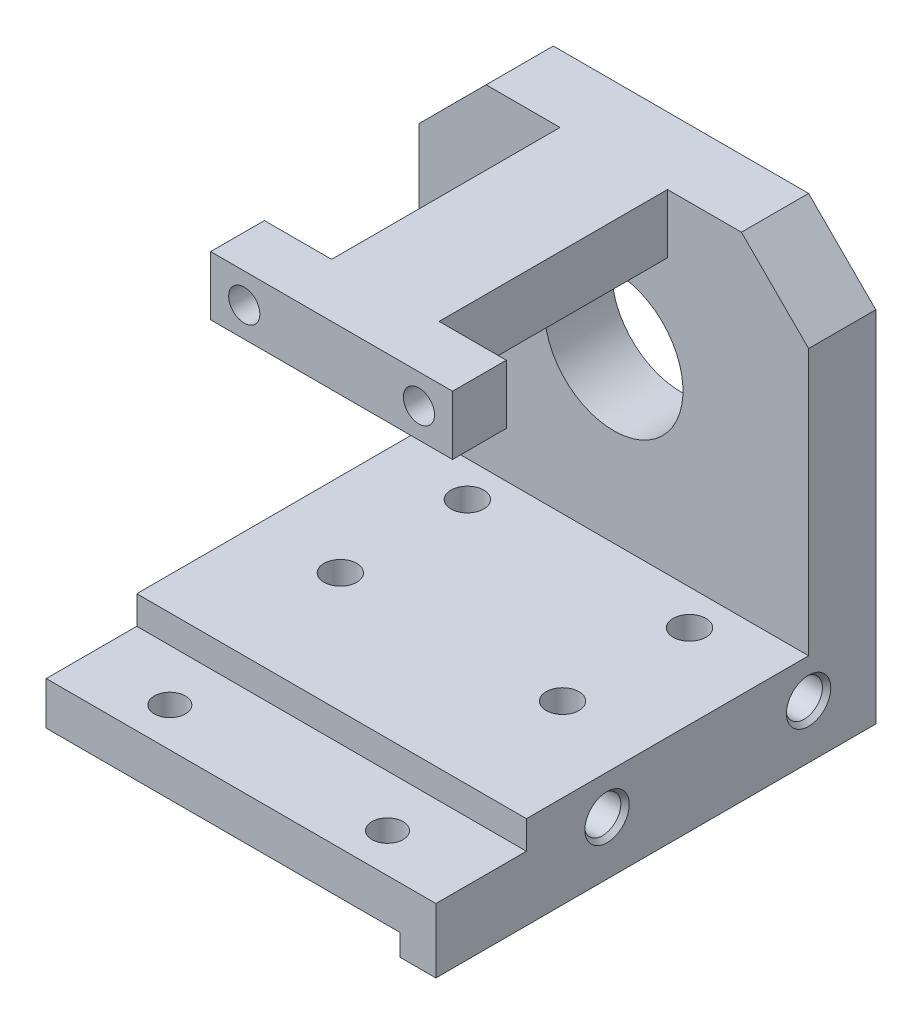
from build123d import *

# Parameters (mm, degrees)
SKETCH1_W                       = 36.83
SKETCH1_H                       = 38.227
EXTRUDE1_DEPTH                  = 6.35
SKETCH8_R                       = 1.5875
EXTRUDE3_DEPTH                  = 0.00254
SKETCH12_R                      = 6.5405
CUT_EXTRUDE3_DEPTH              = 30.745124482
SKETCH13_W                      = 36.83
SKETCH13_H                      = 6.731
EXTRUDE4_DEPTH                  = 36.83
SKETCH14_W                      = 10.16
SKETCH14_H                      = 2.667
CUT_EXTRUDE4_DEPTH              = 62.043154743
SKETCH16_W                      = 3.415000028
SKETCH16_H                      = 43.18
EXTRUDE5_DEPTH                  = 2.032
SKETCH17_W                      = 10.16
SKETCH17_H                      = 5.588
EXTRUDE6_DEPTH                  = 26.67
SKETCH18_W                      = 5.08
SKETCH18_H                      = 5.588
EXTRUDE7_DEPTH                  = 6.35
CHAMFER2_SIZE                   = 6.35
SKETCH21_W                      = 43.18
SKETCH21_H                      = 2.032
CUT_EXTRUDE5_DEPTH              = 60.848673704
F_32_0_116000_DIAMETER_HOLE2_D  = 2.9464
M3_1_3_100000_DIAMETER_HOLE1_D  = 3.1
SKETCH27_W                      = 36.83
SKETCH27_H                      = 6.096
CUT_EXTRUDE7_DEPTH              = 1.6026003
F_8_32_TAPPED_HOLE2_D           = 3.4544
F_8_32_TAPPED_HOLE2_DEPTH       = 10.7188
F_8_32_TAPPED_HOLE2_CSINK_D     = 4.191
F_8_32_TAPPED_HOLE2_CSINK_ANGLE = 82
SKETCH41_R                      = 13.97
SKETCH41_R_2                    = 6.5405
CUT_EXTRUDE9_DEPTH              = 0.254
BOSS_EXTRUDE1_START             = 0.254
SKETCH42_R                      = 7.9375
SKETCH42_R_2                    = 6.5405
BOSS_EXTRUDE1_DEPTH             = 0.254


with BuildPart() as part:
    # Sketch1 → Extrude1 (new body)
    with BuildSketch(Plane.XY):
        with Locations((0, -3.3655)):
            Rectangle(SKETCH1_W, SKETCH1_H)
    extrude(amount=EXTRUDE1_DEPTH)

    # Sketch8 → Extrude3 (add)
    with BuildSketch(Plane(origin=(0, 0, 0), x_dir=(-1, 0, 0), z_dir=(0, 0, -1))):
        with Locations(Location((-1.9685, -3.064398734, 0), (0, 0, 180))):
            Circle(SKETCH8_R)
    extrude(amount=EXTRUDE3_DEPTH)

    # Sketch12 → Cut-Extrude3 (cut, through all)
    with BuildSketch(Plane(origin=(0, 0, -0.00254), x_dir=(-1, 0, 0), z_dir=(0, 0, -1))):
        Circle(SKETCH12_R)
    extrude(amount=-CUT_EXTRUDE3_DEPTH, mode=Mode.SUBTRACT)

    # Sketch13 → Extrude4 (add)
    with BuildSketch(Plane.XY.offset(6.35)):
        with Locations((0, -19.1135)):
            Rectangle(SKETCH13_W, SKETCH13_H)
    extrude(amount=EXTRUDE4_DEPTH)

    # Sketch14 → Cut-Extrude4 (cut, through all)
    with BuildSketch(Plane.ZY.offset(18.415)):
        with Locations((38.1, -17.0815)):
            Rectangle(SKETCH14_W, SKETCH14_H)
    extrude(amount=-CUT_EXTRUDE4_DEPTH, mode=Mode.SUBTRACT)

    # Sketch16 → Extrude5 (add)
    with BuildSketch(Plane.XZ.offset(22.479)):
        with Locations((16.707499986, 21.59)):
            Rectangle(SKETCH16_W, SKETCH16_H)
        with Locations((-16.707499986, 21.59)):
            Rectangle(SKETCH16_W, SKETCH16_H)
    extrude(amount=EXTRUDE5_DEPTH)

    # Sketch17 → Extrude6 (add)
    with BuildSketch(Plane.XY.offset(6.35)):
        with Locations((0, 12.954)):
            Rectangle(SKETCH17_W, SKETCH17_H)
    extrude(amount=EXTRUDE6_DEPTH)

    # Sketch18 → Extrude7 (add)
    with BuildSketch(Plane.ZY.offset(5.08)):
        with Locations((30.48, 12.954)):
            Rectangle(SKETCH18_W, SKETCH18_H)
    extrude7 = extrude(amount=EXTRUDE7_DEPTH)

    # Mirror1: Extrude7 across plane
    add(extrude7.mirror(Plane(origin=(0, 0, 0), x_dir=(0, 0, 1), z_dir=(1, 0, 0))))

    # Sketch19 → 32 _0.116000_ Diameter Hole1 (revolve, cut)
    with BuildSketch(Plane(origin=(-8.255, 12.954, 27.94), x_dir=(0, 1, 0), z_dir=(1, 0, 0))):
        Polygon((0, 0), (0, 26.285187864), (1.4732, 25.4), (1.4732, 0), align=None)
    f_32_0_116000_diameter_hole1 = revolve(axis=Axis((-8.255, 12.954, 21.59), (0, 0, 1)), mode=Mode.SUBTRACT)

    # Mirror2: 32 _0.116000_ Diameter Hole1 across plane
    add(f_32_0_116000_diameter_hole1.mirror(Plane(origin=(0, 0, 0), x_dir=(0, 0, 1), z_dir=(1, 0, 0))), mode=Mode.SUBTRACT)

    # Chamfer2
    chamfer2_edges = [part.edges().sort_by_distance(p)[0] for p in [
        (18.415, 15.748, 3.175),
        (-18.415, 15.748, 3.175),
    ]]
    chamfer(chamfer2_edges, length=CHAMFER2_SIZE)

    # Sketch21 → Cut-Extrude5 (cut, through all)
    with BuildSketch(Plane(origin=(-14.999999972, 0, 0), x_dir=(0, 0, -1), z_dir=(1, 0, 0))):
        with Locations((-21.59, -23.495)):
            Rectangle(SKETCH21_W, SKETCH21_H)
    extrude(amount=-CUT_EXTRUDE5_DEPTH, mode=Mode.SUBTRACT)

    # 32 _0.116000_ Diameter Hole2 (through all)
    with Locations(Plane.XZ.offset(22.479)):
        with Locations((10.16, 37.8943997), (-10.414, 37.8943997)):
            Hole(F_32_0_116000_DIAMETER_HOLE2_D / 2)

    # M3.1 _3.100000_ Diameter Hole1 (through all)
    with Locations(Plane(origin=(0, -15.748, 0), x_dir=(-1, 0, 0), z_dir=(0, 1, 0))):
        with Locations((-10.500000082, 9.689999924), (10.500000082, 9.689999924), (10.500000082, 21.690000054), (-10.500000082, 21.690000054)):
            Hole(M3_1_3_100000_DIAMETER_HOLE1_D / 2)

    # Sketch27 → Cut-Extrude7 (cut)
    with BuildSketch(Plane.XY.offset(43.18)):
        with Locations((0, -21.463)):
            Rectangle(SKETCH27_W, SKETCH27_H)
    extrude(amount=-CUT_EXTRUDE7_DEPTH, mode=Mode.SUBTRACT)

    # 8-32 Tapped Hole2
    with Locations(Plane(origin=(18.415, -19.431, 6.35), x_dir=(0, 1, 0), z_dir=(1, 0, 0))):
        with Locations((0, 0), (0, 19.05)):
            CounterSinkHole(F_8_32_TAPPED_HOLE2_D / 2, F_8_32_TAPPED_HOLE2_CSINK_D / 2, depth=F_8_32_TAPPED_HOLE2_DEPTH, counter_sink_angle=F_8_32_TAPPED_HOLE2_CSINK_ANGLE)

    # Sketch41 → Cut-Extrude9 (cut)
    with BuildSketch(Plane(origin=(0, 0, 0), x_dir=(-1, 0, 0), z_dir=(0, 0, -1))):
        Circle(SKETCH41_R)
        Circle(SKETCH41_R_2, mode=Mode.SUBTRACT)
    extrude(amount=-CUT_EXTRUDE9_DEPTH, mode=Mode.SUBTRACT)

    # Sketch42 → Boss-Extrude1 (add)
    with BuildSketch(Plane(origin=(0, 0, 0.254), x_dir=(-1, 0, 0), z_dir=(0, 0, -1)).offset(BOSS_EXTRUDE1_START)):
        Circle(SKETCH42_R)
        Circle(SKETCH42_R_2, mode=Mode.SUBTRACT)
    extrude(amount=-BOSS_EXTRUDE1_DEPTH)


solid = part.part
